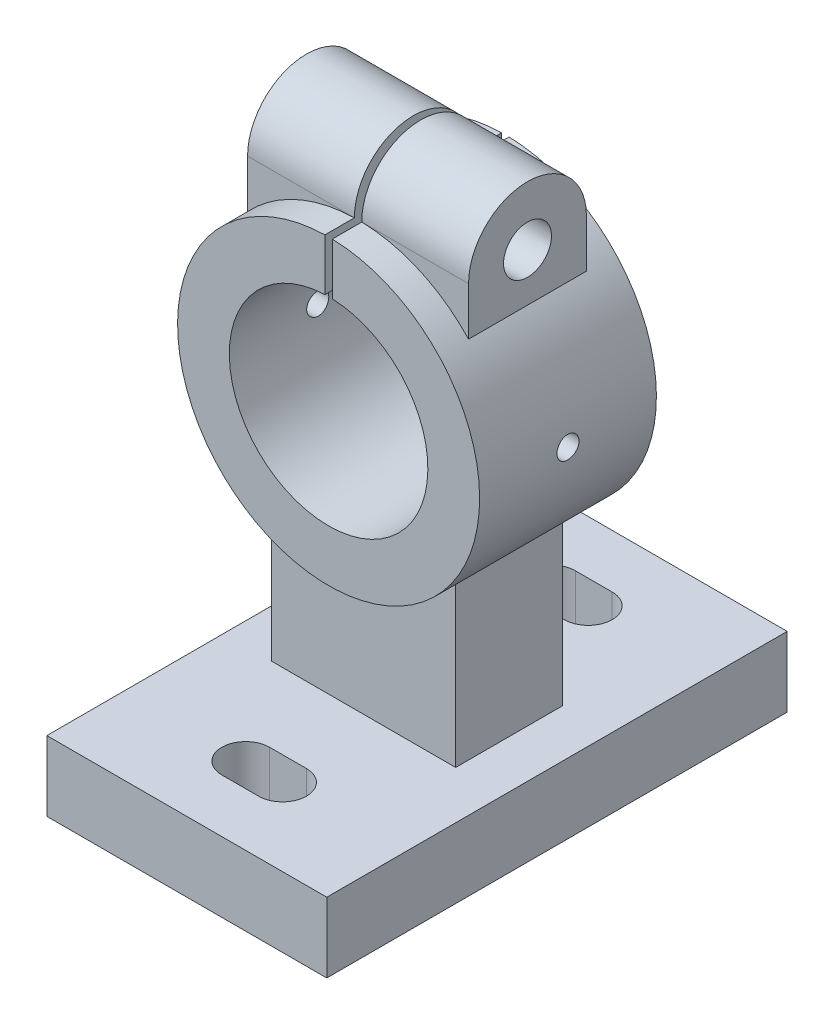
from build123d import *

# Parameters (mm, degrees)
SKETCH1_R           = 26.95
BOSS_EXTRUDE1_DEPTH = 14.5
SKETCH2_R           = 41
SKETCH2_R_2         = 26.95
BOSS_EXTRUDE2_DEPTH = 24
SKETCH3_W           = 76
SKETCH3_H           = 125
BOSS_EXTRUDE3_DEPTH = 19
SKETCH6_R           = 6.5
BOSS_EXTRUDE4_DEPTH = 30
CUT_EXTRUDE1_DEPTH  = 30
SKETCH8_R           = 3
CUT_EXTRUDE2_DEPTH  = 55


with BuildPart() as part:
    # Sketch1 → Boss-Extrude1 (new, symmetric)
    with BuildSketch(Plane.XY):
        with BuildLine():
            Line((-25, -32.496153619), (-25, -76))
            Line((-25, -76), (-38, -76))
            Line((-38, -76), (-38, -95))
            Line((-38, -95), (38, -95))
            Line((38, -95), (38, -76))
            Line((38, -76), (25, -76))
            Line((25, -76), (25, -32.496153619))
            ThreePointArc((25, -32.496153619), (0, 41), (-25, -32.496153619))
        make_face()
        with Locations(Location((0, 0, 0), (0, 0, 180))):
            Circle(SKETCH1_R, mode=Mode.SUBTRACT)
    extrude(amount=BOSS_EXTRUDE1_DEPTH, both=True)

    # Sketch2 → Boss-Extrude2 (add, symmetric)
    with BuildSketch(Plane.XY):
        Circle(SKETCH2_R)
        with Locations(Location((0, 0, 0), (0, 0, 180))):
            Circle(SKETCH2_R_2, mode=Mode.SUBTRACT)
    extrude(amount=BOSS_EXTRUDE2_DEPTH, both=True)

    # Sketch3 → Boss-Extrude3 (add)
    with BuildSketch(Plane.XZ.offset(95)):
        Rectangle(SKETCH3_W, SKETCH3_H)
        with BuildLine():
            Line((-5, 48), (5, 48))
            ThreePointArc((5, 48), (11.5, 41.5), (5, 35))
            Line((5, 35), (-5, 35))
            ThreePointArc((-5, 35), (-11.5, 41.5), (-5, 48))
        make_face(mode=Mode.SUBTRACT)
        with BuildLine():
            Line((-5, -48), (5, -48))
            ThreePointArc((5, -48), (11.5, -41.5), (5, -35))
            Line((5, -35), (-5, -35))
            ThreePointArc((-5, -35), (-11.5, -41.5), (-5, -48))
        make_face(mode=Mode.SUBTRACT)
    extrude(amount=-BOSS_EXTRUDE3_DEPTH)

    # Sketch6 → Boss-Extrude4 (add, symmetric)
    with BuildSketch(Plane(origin=(0, 0, 0), x_dir=(0, 0, -1), z_dir=(1, 0, 0))):
        with BuildLine():
            Line((-16, 41), (-16, 26.95))
            Line((-16, 26.95), (16, 26.95))
            Line((16, 26.95), (16, 41))
            ThreePointArc((16, 41), (0, 57), (-16, 41))
        make_face()
        with Locations((0, 41)):
            Circle(SKETCH6_R, mode=Mode.SUBTRACT)
    extrude(amount=BOSS_EXTRUDE4_DEPTH, both=True)

    # Sketch7 → Cut-Extrude1 (cut, symmetric)
    with BuildSketch(Plane.XY):
        with BuildLine():
            Line((1, 26.931440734), (1, 57))
            Line((1, 57), (-1, 57))
            Line((-1, 57), (-1, 26.931440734))
            ThreePointArc((-1, 26.931440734), (0, 26.95), (1, 26.931440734))
        make_face()
    extrude(amount=CUT_EXTRUDE1_DEPTH, both=True, mode=Mode.SUBTRACT)

    # Sketch8 → Cut-Extrude2 (cut, symmetric)
    with BuildSketch(Plane(origin=(0, 0, 0), x_dir=(0, 0, -1), z_dir=(1, 0, 0))):
        Circle(SKETCH8_R)
    extrude(amount=CUT_EXTRUDE2_DEPTH, both=True, mode=Mode.SUBTRACT)


solid = part.part
